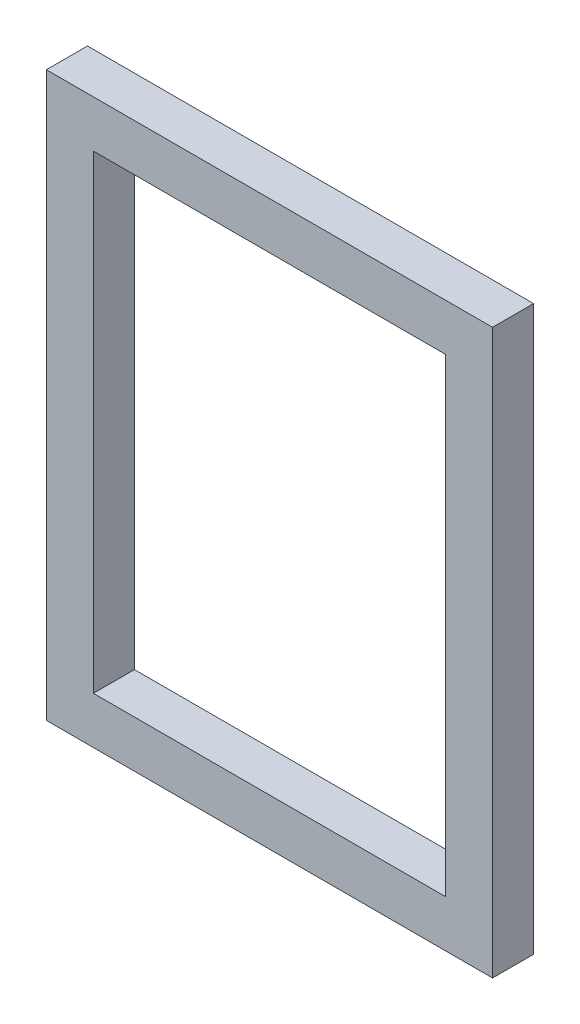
ISO-10303-21;
HEADER;
FILE_DESCRIPTION(('STEP AP214'),'2;1');
FILE_NAME('part.step','',(''),(''),'','','');
FILE_SCHEMA(('AUTOMOTIVE_DESIGN { 1 0 10303 214 1 1 1 1 }'));
ENDSEC;
DATA;
#1=APPLICATION_CONTEXT('core data for automotive mechanical design processes');
#2=APPLICATION_PROTOCOL_DEFINITION('international standard','automotive_design',2000,#1);
#3=PRODUCT_CONTEXT('',#1,'mechanical');
#4=PRODUCT('Part','Part','',(#3));
#5=PRODUCT_RELATED_PRODUCT_CATEGORY('part','',(#4));
#6=PRODUCT_DEFINITION_FORMATION('','',#4);
#7=PRODUCT_DEFINITION_CONTEXT('part definition',#1,'design');
#8=PRODUCT_DEFINITION('design','',#6,#7);
#9=PRODUCT_DEFINITION_SHAPE('','',#8);
#10=(LENGTH_UNIT() NAMED_UNIT(*) SI_UNIT(.MILLI.,.METRE.));
#11=(NAMED_UNIT(*) PLANE_ANGLE_UNIT() SI_UNIT($,.RADIAN.));
#12=(NAMED_UNIT(*) SI_UNIT($,.STERADIAN.) SOLID_ANGLE_UNIT());
#13=UNCERTAINTY_MEASURE_WITH_UNIT(LENGTH_MEASURE(1.E-05),#10,'distance_accuracy_value','');
#14=(GEOMETRIC_REPRESENTATION_CONTEXT(3) GLOBAL_UNCERTAINTY_ASSIGNED_CONTEXT((#13)) GLOBAL_UNIT_ASSIGNED_CONTEXT((#10,
#11,#12)) REPRESENTATION_CONTEXT('',''));
#15=CARTESIAN_POINT('',(0.,0.,0.));
#16=DIRECTION('',(0.,0.,1.));
#17=DIRECTION('',(1.,0.,0.));
#18=AXIS2_PLACEMENT_3D('',#15,#16,#17);
#19=CARTESIAN_POINT('',(600.,1000.,35.));
#20=DIRECTION('',(0.,-1.,0.));
#21=DIRECTION('',(0.,0.,-1.));
#22=AXIS2_PLACEMENT_3D('',#19,#20,#21);
#23=PLANE('',#22);
#24=CARTESIAN_POINT('',(300.,1000.,35.));
#25=DIRECTION('',(0.,0.,-1.));
#26=VECTOR('',#25,1.);
#27=LINE('',#24,#26);
#28=CARTESIAN_POINT('',(300.,1000.,35.));
#29=VERTEX_POINT('',#28);
#30=CARTESIAN_POINT('',(300.,1000.,0.));
#31=VERTEX_POINT('',#30);
#32=EDGE_CURVE('E12',#29,#31,#27,.T.);
#33=ORIENTED_EDGE('',*,*,#32,.F.);
#34=DIRECTION('',(-1.,0.,0.));
#35=VECTOR('',#34,1.);
#36=CARTESIAN_POINT('',(600.,1000.,35.));
#37=LINE('',#36,#35);
#38=CARTESIAN_POINT('',(600.,1000.,35.));
#39=VERTEX_POINT('',#38);
#40=EDGE_CURVE('E131',#39,#29,#37,.T.);
#41=ORIENTED_EDGE('',*,*,#40,.F.);
#42=DIRECTION('',(0.,0.,1.));
#43=VECTOR('',#42,1.);
#44=CARTESIAN_POINT('',(600.,1000.,35.));
#45=LINE('',#44,#43);
#46=CARTESIAN_POINT('',(600.,1000.,0.));
#47=VERTEX_POINT('',#46);
#48=EDGE_CURVE('E209',#47,#39,#45,.T.);
#49=ORIENTED_EDGE('',*,*,#48,.F.);
#50=DIRECTION('',(-1.,0.,0.));
#51=VECTOR('',#50,1.);
#52=CARTESIAN_POINT('',(600.,1000.,0.));
#53=LINE('',#52,#51);
#54=EDGE_CURVE('E124',#47,#31,#53,.T.);
#55=ORIENTED_EDGE('',*,*,#54,.T.);
#56=EDGE_LOOP('',(#33,#41,#49,#55));
#57=FACE_BOUND('',#56,.T.);
#58=ADVANCED_FACE('F36',(#57),#23,.F.);
#59=CARTESIAN_POINT('',(640.,960.,35.));
#60=DIRECTION('',(0.,1.,0.));
#61=DIRECTION('',(0.,0.,1.));
#62=AXIS2_PLACEMENT_3D('',#59,#60,#61);
#63=PLANE('',#62);
#64=CARTESIAN_POINT('',(260.,960.,0.));
#65=DIRECTION('',(0.,0.,1.));
#66=VECTOR('',#65,1.);
#67=LINE('',#64,#66);
#68=CARTESIAN_POINT('',(260.,960.,0.));
#69=VERTEX_POINT('',#68);
#70=CARTESIAN_POINT('',(260.,960.,35.));
#71=VERTEX_POINT('',#70);
#72=EDGE_CURVE('E46',#69,#71,#67,.T.);
#73=ORIENTED_EDGE('',*,*,#72,.F.);
#74=DIRECTION('',(-1.,0.,0.));
#75=VECTOR('',#74,1.);
#76=CARTESIAN_POINT('',(640.,960.,0.));
#77=LINE('',#76,#75);
#78=CARTESIAN_POINT('',(640.,960.,0.));
#79=VERTEX_POINT('',#78);
#80=EDGE_CURVE('E130',#79,#69,#77,.T.);
#81=ORIENTED_EDGE('',*,*,#80,.F.);
#82=DIRECTION('',(0.,0.,-1.));
#83=VECTOR('',#82,1.);
#84=CARTESIAN_POINT('',(640.,960.,35.));
#85=LINE('',#84,#83);
#86=CARTESIAN_POINT('',(640.,960.,35.));
#87=VERTEX_POINT('',#86);
#88=EDGE_CURVE('E128',#87,#79,#85,.T.);
#89=ORIENTED_EDGE('',*,*,#88,.F.);
#90=DIRECTION('',(-1.,0.,0.));
#91=VECTOR('',#90,1.);
#92=CARTESIAN_POINT('',(640.,960.,35.));
#93=LINE('',#92,#91);
#94=EDGE_CURVE('E107',#87,#71,#93,.T.);
#95=ORIENTED_EDGE('',*,*,#94,.T.);
#96=EDGE_LOOP('',(#73,#81,#89,#95));
#97=FACE_BOUND('',#96,.T.);
#98=ADVANCED_FACE('F38',(#97),#63,.F.);
#99=CARTESIAN_POINT('',(640.,1440.,35.));
#100=DIRECTION('',(1.,0.,0.));
#101=DIRECTION('',(0.,1.,0.));
#102=AXIS2_PLACEMENT_3D('',#99,#100,#101);
#103=PLANE('',#102);
#104=DIRECTION('',(0.,-1.,0.));
#105=VECTOR('',#104,1.);
#106=CARTESIAN_POINT('',(640.,1440.,35.));
#107=LINE('',#106,#105);
#108=CARTESIAN_POINT('',(640.,1440.,35.));
#109=VERTEX_POINT('',#108);
#110=EDGE_CURVE('E233',#109,#87,#107,.T.);
#111=ORIENTED_EDGE('',*,*,#110,.T.);
#112=ORIENTED_EDGE('',*,*,#88,.T.);
#113=DIRECTION('',(0.,-1.,0.));
#114=VECTOR('',#113,1.);
#115=CARTESIAN_POINT('',(640.,1440.,0.));
#116=LINE('',#115,#114);
#117=CARTESIAN_POINT('',(640.,1440.,0.));
#118=VERTEX_POINT('',#117);
#119=EDGE_CURVE('E230',#118,#79,#116,.T.);
#120=ORIENTED_EDGE('',*,*,#119,.F.);
#121=DIRECTION('',(0.,0.,1.));
#122=VECTOR('',#121,1.);
#123=CARTESIAN_POINT('',(640.,1440.,35.));
#124=LINE('',#123,#122);
#125=EDGE_CURVE('E237',#118,#109,#124,.T.);
#126=ORIENTED_EDGE('',*,*,#125,.T.);
#127=EDGE_LOOP('',(#111,#112,#120,#126));
#128=FACE_BOUND('',#127,.T.);
#129=ADVANCED_FACE('F183',(#128),#103,.T.);
#130=CARTESIAN_POINT('',(600.,1400.,35.));
#131=DIRECTION('',(-1.,0.,0.));
#132=DIRECTION('',(0.,-1.,0.));
#133=AXIS2_PLACEMENT_3D('',#130,#131,#132);
#134=PLANE('',#133);
#135=DIRECTION('',(0.,-1.,0.));
#136=VECTOR('',#135,1.);
#137=CARTESIAN_POINT('',(600.,1400.,0.));
#138=LINE('',#137,#136);
#139=CARTESIAN_POINT('',(600.,1400.,0.));
#140=VERTEX_POINT('',#139);
#141=EDGE_CURVE('E212',#140,#47,#138,.T.);
#142=ORIENTED_EDGE('',*,*,#141,.T.);
#143=ORIENTED_EDGE('',*,*,#48,.T.);
#144=DIRECTION('',(0.,-1.,0.));
#145=VECTOR('',#144,1.);
#146=CARTESIAN_POINT('',(600.,1400.,35.));
#147=LINE('',#146,#145);
#148=CARTESIAN_POINT('',(600.,1400.,35.));
#149=VERTEX_POINT('',#148);
#150=EDGE_CURVE('E225',#149,#39,#147,.T.);
#151=ORIENTED_EDGE('',*,*,#150,.F.);
#152=DIRECTION('',(0.,0.,-1.));
#153=VECTOR('',#152,1.);
#154=CARTESIAN_POINT('',(600.,1400.,35.));
#155=LINE('',#154,#153);
#156=EDGE_CURVE('E235',#149,#140,#155,.T.);
#157=ORIENTED_EDGE('',*,*,#156,.T.);
#158=EDGE_LOOP('',(#142,#143,#151,#157));
#159=FACE_BOUND('',#158,.T.);
#160=ADVANCED_FACE('F178',(#159),#134,.T.);
#161=CARTESIAN_POINT('',(260.,1440.,35.));
#162=DIRECTION('',(0.,-1.,0.));
#163=DIRECTION('',(0.,0.,-1.));
#164=AXIS2_PLACEMENT_3D('',#161,#162,#163);
#165=PLANE('',#164);
#166=ORIENTED_EDGE('',*,*,#125,.F.);
#167=DIRECTION('',(1.,0.,0.));
#168=VECTOR('',#167,1.);
#169=CARTESIAN_POINT('',(260.,1440.,0.));
#170=LINE('',#169,#168);
#171=CARTESIAN_POINT('',(260.,1440.,0.));
#172=VERTEX_POINT('',#171);
#173=EDGE_CURVE('E240',#172,#118,#170,.T.);
#174=ORIENTED_EDGE('',*,*,#173,.F.);
#175=DIRECTION('',(0.,0.,-1.));
#176=VECTOR('',#175,1.);
#177=CARTESIAN_POINT('',(260.,1440.,35.));
#178=LINE('',#177,#176);
#179=CARTESIAN_POINT('',(260.,1440.,35.));
#180=VERTEX_POINT('',#179);
#181=EDGE_CURVE('E114',#180,#172,#178,.T.);
#182=ORIENTED_EDGE('',*,*,#181,.F.);
#183=DIRECTION('',(1.,0.,0.));
#184=VECTOR('',#183,1.);
#185=CARTESIAN_POINT('',(260.,1440.,35.));
#186=LINE('',#185,#184);
#187=EDGE_CURVE('E110',#180,#109,#186,.T.);
#188=ORIENTED_EDGE('',*,*,#187,.T.);
#189=EDGE_LOOP('',(#166,#174,#182,#188));
#190=FACE_BOUND('',#189,.T.);
#191=ADVANCED_FACE('F167',(#190),#165,.F.);
#192=CARTESIAN_POINT('',(300.,1400.,35.));
#193=DIRECTION('',(0.,1.,0.));
#194=DIRECTION('',(0.,0.,1.));
#195=AXIS2_PLACEMENT_3D('',#192,#193,#194);
#196=PLANE('',#195);
#197=ORIENTED_EDGE('',*,*,#156,.F.);
#198=DIRECTION('',(1.,0.,0.));
#199=VECTOR('',#198,1.);
#200=CARTESIAN_POINT('',(300.,1400.,35.));
#201=LINE('',#200,#199);
#202=CARTESIAN_POINT('',(300.,1400.,35.));
#203=VERTEX_POINT('',#202);
#204=EDGE_CURVE('E223',#203,#149,#201,.T.);
#205=ORIENTED_EDGE('',*,*,#204,.F.);
#206=DIRECTION('',(0.,0.,1.));
#207=VECTOR('',#206,1.);
#208=CARTESIAN_POINT('',(300.,1400.,35.));
#209=LINE('',#208,#207);
#210=CARTESIAN_POINT('',(300.,1400.,0.));
#211=VERTEX_POINT('',#210);
#212=EDGE_CURVE('E218',#211,#203,#209,.T.);
#213=ORIENTED_EDGE('',*,*,#212,.F.);
#214=DIRECTION('',(1.,0.,0.));
#215=VECTOR('',#214,1.);
#216=CARTESIAN_POINT('',(300.,1400.,0.));
#217=LINE('',#216,#215);
#218=EDGE_CURVE('E215',#211,#140,#217,.T.);
#219=ORIENTED_EDGE('',*,*,#218,.T.);
#220=EDGE_LOOP('',(#197,#205,#213,#219));
#221=FACE_BOUND('',#220,.T.);
#222=ADVANCED_FACE('F177',(#221),#196,.F.);
#223=CARTESIAN_POINT('',(260.,1546.30145812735,35.));
#224=DIRECTION('',(0.,0.,1.));
#225=DIRECTION('',(1.,0.,0.));
#226=AXIS2_PLACEMENT_3D('',#223,#224,#225);
#227=PLANE('',#226);
#228=ORIENTED_EDGE('',*,*,#187,.F.);
#229=DIRECTION('',(0.,-1.,0.));
#230=VECTOR('',#229,1.);
#231=CARTESIAN_POINT('',(260.,1546.30145812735,35.));
#232=LINE('',#231,#230);
#233=EDGE_CURVE('E102',#180,#71,#232,.T.);
#234=ORIENTED_EDGE('',*,*,#233,.T.);
#235=ORIENTED_EDGE('',*,*,#94,.F.);
#236=ORIENTED_EDGE('',*,*,#110,.F.);
#237=EDGE_LOOP('',(#228,#234,#235,#236));
#238=FACE_BOUND('',#237,.T.);
#239=DIRECTION('',(0.,-1.,0.));
#240=VECTOR('',#239,1.);
#241=CARTESIAN_POINT('',(300.,1546.30145812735,35.));
#242=LINE('',#241,#240);
#243=EDGE_CURVE('E115',#203,#29,#242,.T.);
#244=ORIENTED_EDGE('',*,*,#243,.F.);
#245=ORIENTED_EDGE('',*,*,#204,.T.);
#246=ORIENTED_EDGE('',*,*,#150,.T.);
#247=ORIENTED_EDGE('',*,*,#40,.T.);
#248=EDGE_LOOP('',(#244,#245,#246,#247));
#249=FACE_BOUND('',#248,.T.);
#250=ADVANCED_FACE('F104',(#238,#249),#227,.T.);
#251=CARTESIAN_POINT('',(300.,1546.30145812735,35.));
#252=DIRECTION('',(1.,0.,0.));
#253=DIRECTION('',(0.,1.,0.));
#254=AXIS2_PLACEMENT_3D('',#251,#252,#253);
#255=PLANE('',#254);
#256=DIRECTION('',(0.,-1.,0.));
#257=VECTOR('',#256,1.);
#258=CARTESIAN_POINT('',(300.,1546.30145812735,0.));
#259=LINE('',#258,#257);
#260=EDGE_CURVE('E141',#211,#31,#259,.T.);
#261=ORIENTED_EDGE('',*,*,#260,.F.);
#262=ORIENTED_EDGE('',*,*,#212,.T.);
#263=ORIENTED_EDGE('',*,*,#243,.T.);
#264=ORIENTED_EDGE('',*,*,#32,.T.);
#265=EDGE_LOOP('',(#261,#262,#263,#264));
#266=FACE_BOUND('',#265,.T.);
#267=ADVANCED_FACE('F150',(#266),#255,.T.);
#268=CARTESIAN_POINT('',(260.,1546.30145812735,0.));
#269=DIRECTION('',(0.,0.,-1.));
#270=DIRECTION('',(-1.,0.,0.));
#271=AXIS2_PLACEMENT_3D('',#268,#269,#270);
#272=PLANE('',#271);
#273=ORIENTED_EDGE('',*,*,#218,.F.);
#274=ORIENTED_EDGE('',*,*,#260,.T.);
#275=ORIENTED_EDGE('',*,*,#54,.F.);
#276=ORIENTED_EDGE('',*,*,#141,.F.);
#277=EDGE_LOOP('',(#273,#274,#275,#276));
#278=FACE_BOUND('',#277,.T.);
#279=DIRECTION('',(0.,-1.,0.));
#280=VECTOR('',#279,1.);
#281=CARTESIAN_POINT('',(260.,1546.30145812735,0.));
#282=LINE('',#281,#280);
#283=EDGE_CURVE('E120',#172,#69,#282,.T.);
#284=ORIENTED_EDGE('',*,*,#283,.F.);
#285=ORIENTED_EDGE('',*,*,#173,.T.);
#286=ORIENTED_EDGE('',*,*,#119,.T.);
#287=ORIENTED_EDGE('',*,*,#80,.T.);
#288=EDGE_LOOP('',(#284,#285,#286,#287));
#289=FACE_BOUND('',#288,.T.);
#290=ADVANCED_FACE('F160',(#278,#289),#272,.T.);
#291=CARTESIAN_POINT('',(260.,1546.30145812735,35.));
#292=DIRECTION('',(-1.,0.,0.));
#293=DIRECTION('',(0.,-1.,0.));
#294=AXIS2_PLACEMENT_3D('',#291,#292,#293);
#295=PLANE('',#294);
#296=ORIENTED_EDGE('',*,*,#233,.F.);
#297=ORIENTED_EDGE('',*,*,#181,.T.);
#298=ORIENTED_EDGE('',*,*,#283,.T.);
#299=ORIENTED_EDGE('',*,*,#72,.T.);
#300=EDGE_LOOP('',(#296,#297,#298,#299));
#301=FACE_BOUND('',#300,.T.);
#302=ADVANCED_FACE('F118',(#301),#295,.T.);
#303=CLOSED_SHELL('',(#58,#98,#129,#160,#191,#222,#250,#267,#290,#302));
#304=MANIFOLD_SOLID_BREP('B2',#303);
#305=ADVANCED_BREP_SHAPE_REPRESENTATION('',(#18,#304),#14);
#306=SHAPE_DEFINITION_REPRESENTATION(#9,#305);
ENDSEC;
END-ISO-10303-21;
